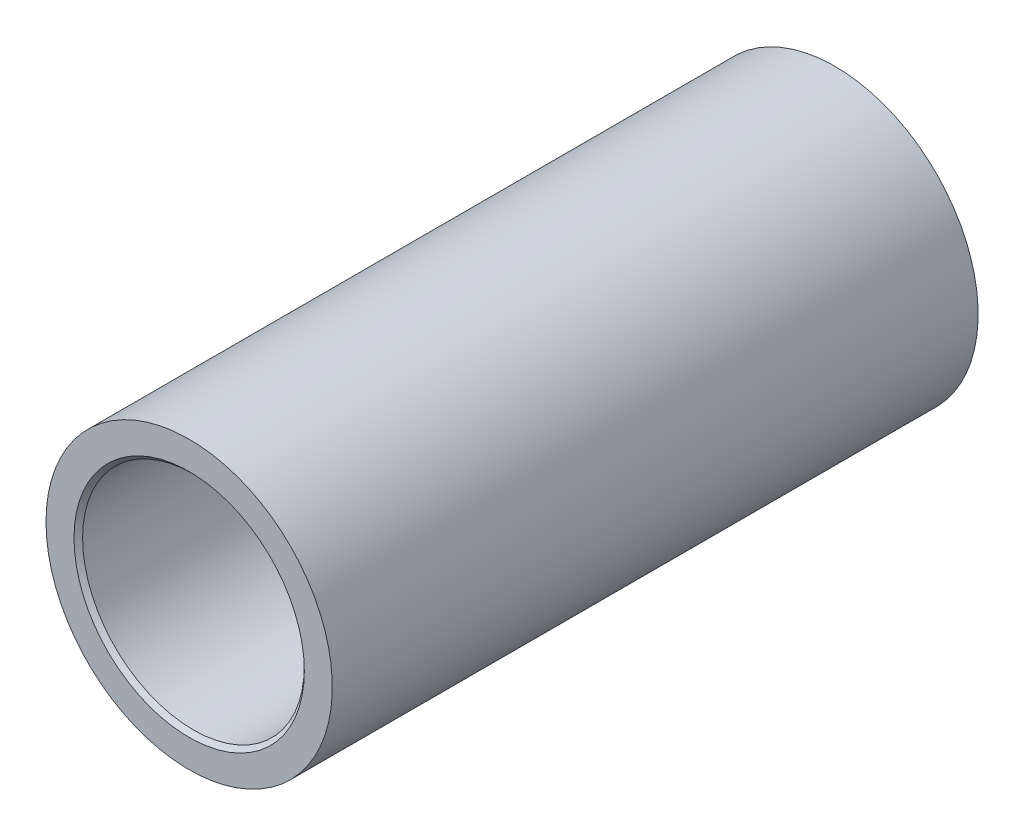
from build123d import *

# Parameters (mm, degrees)
SKETCH1_R           = 8.4455
SKETCH1_R_2         = 6.5405
BOSS_EXTRUDE1_DEPTH = 38.1
CHAMFER1_SIZE       = 0.254


with BuildPart() as part:
    # Sketch1 → Boss-Extrude1 (new body)
    with BuildSketch(Plane.XY):
        with Locations(Location((0, 0, 0), (0, 0, 180))):
            Circle(SKETCH1_R)
        with Locations(Location((0, 0, 0), (0, 0, 180))):
            Circle(SKETCH1_R_2, mode=Mode.SUBTRACT)
    extrude(amount=BOSS_EXTRUDE1_DEPTH)

    # Chamfer1
    chamfer1_edges = [part.edges().sort_by_distance(p)[0] for p in [
        (6.5405, 0, 0),
        (6.5405, 0, 38.1),
    ]]
    chamfer(chamfer1_edges, length=CHAMFER1_SIZE)


solid = part.part
